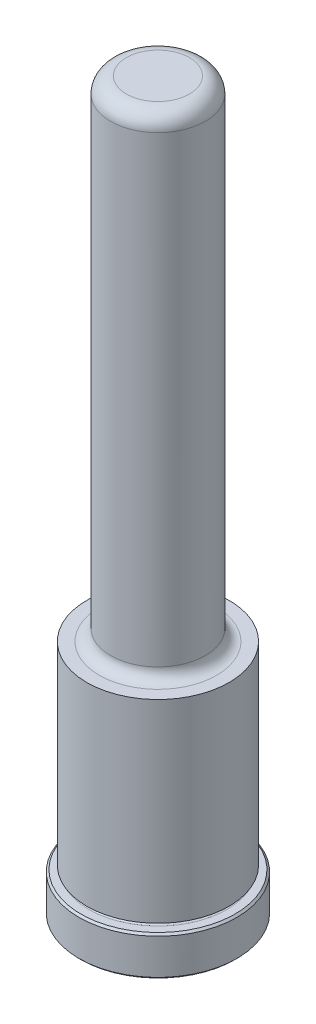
ISO-10303-21;
HEADER;
FILE_DESCRIPTION(('STEP AP214'),'2;1');
FILE_NAME('part.step','',(''),(''),'','','');
FILE_SCHEMA(('AUTOMOTIVE_DESIGN { 1 0 10303 214 1 1 1 1 }'));
ENDSEC;
DATA;
#1=APPLICATION_CONTEXT('core data for automotive mechanical design processes');
#2=APPLICATION_PROTOCOL_DEFINITION('international standard','automotive_design',2000,#1);
#3=PRODUCT_CONTEXT('',#1,'mechanical');
#4=PRODUCT('Part','Part','',(#3));
#5=PRODUCT_RELATED_PRODUCT_CATEGORY('part','',(#4));
#6=PRODUCT_DEFINITION_FORMATION('','',#4);
#7=PRODUCT_DEFINITION_CONTEXT('part definition',#1,'design');
#8=PRODUCT_DEFINITION('design','',#6,#7);
#9=PRODUCT_DEFINITION_SHAPE('','',#8);
#10=(LENGTH_UNIT() NAMED_UNIT(*) SI_UNIT(.MILLI.,.METRE.));
#11=(NAMED_UNIT(*) PLANE_ANGLE_UNIT() SI_UNIT($,.RADIAN.));
#12=(NAMED_UNIT(*) SI_UNIT($,.STERADIAN.) SOLID_ANGLE_UNIT());
#13=UNCERTAINTY_MEASURE_WITH_UNIT(LENGTH_MEASURE(1.E-05),#10,'distance_accuracy_value','');
#14=(GEOMETRIC_REPRESENTATION_CONTEXT(3) GLOBAL_UNCERTAINTY_ASSIGNED_CONTEXT((#13)) GLOBAL_UNIT_ASSIGNED_CONTEXT((#10,
#11,#12)) REPRESENTATION_CONTEXT('',''));
#15=CARTESIAN_POINT('',(0.,0.,0.));
#16=DIRECTION('',(0.,0.,1.));
#17=DIRECTION('',(1.,0.,0.));
#18=AXIS2_PLACEMENT_3D('',#15,#16,#17);
#19=CARTESIAN_POINT('',(0.,0.,0.));
#20=DIRECTION('',(0.,1.,0.));
#21=DIRECTION('',(0.,0.,1.));
#22=AXIS2_PLACEMENT_3D('',#19,#20,#21);
#23=PLANE('',#22);
#24=CARTESIAN_POINT('',(0.,0.,0.));
#25=DIRECTION('',(0.,1.,0.));
#26=DIRECTION('',(0.,0.,1.));
#27=AXIS2_PLACEMENT_3D('',#24,#25,#26);
#28=CIRCLE('',#27,15.494);
#29=CARTESIAN_POINT('',(0.,0.,15.494));
#30=VERTEX_POINT('',#29);
#31=EDGE_CURVE('E46',#30,#30,#28,.F.);
#32=ORIENTED_EDGE('',*,*,#31,.T.);
#33=EDGE_LOOP('',(#32));
#34=FACE_BOUND('',#33,.T.);
#35=ADVANCED_FACE('F31',(#34),#23,.F.);
#36=CARTESIAN_POINT('',(0.,0.,0.));
#37=DIRECTION('',(0.,1.,0.));
#38=DIRECTION('',(0.,0.,1.));
#39=AXIS2_PLACEMENT_3D('',#36,#37,#38);
#40=CYLINDRICAL_SURFACE('',#39,15.875);
#41=CARTESIAN_POINT('',(0.,0.38099999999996,0.));
#42=DIRECTION('',(0.,1.,0.));
#43=DIRECTION('',(0.,0.,1.));
#44=AXIS2_PLACEMENT_3D('',#41,#42,#43);
#45=CIRCLE('',#44,15.875);
#46=CARTESIAN_POINT('',(0.,0.380999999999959,15.875));
#47=VERTEX_POINT('',#46);
#48=EDGE_CURVE('E51',#47,#47,#45,.T.);
#49=ORIENTED_EDGE('',*,*,#48,.T.);
#50=EDGE_LOOP('',(#49));
#51=FACE_BOUND('',#50,.T.);
#52=CARTESIAN_POINT('',(0.,7.5438,0.));
#53=DIRECTION('',(0.,-1.,0.));
#54=DIRECTION('',(0.,0.,-1.));
#55=AXIS2_PLACEMENT_3D('',#52,#53,#54);
#56=CIRCLE('',#55,15.875);
#57=CARTESIAN_POINT('',(0.,7.5438,-15.875));
#58=VERTEX_POINT('',#57);
#59=EDGE_CURVE('E54',#58,#58,#56,.T.);
#60=ORIENTED_EDGE('',*,*,#59,.T.);
#61=EDGE_LOOP('',(#60));
#62=FACE_BOUND('',#61,.T.);
#63=ADVANCED_FACE('F110',(#51,#62),#40,.T.);
#64=CARTESIAN_POINT('',(0.,7.9248,-15.875));
#65=DIRECTION('',(0.,-1.,0.));
#66=DIRECTION('',(0.,0.,-1.));
#67=AXIS2_PLACEMENT_3D('',#64,#65,#66);
#68=PLANE('',#67);
#69=CARTESIAN_POINT('',(0.,7.9248,0.));
#70=DIRECTION('',(0.,-1.,0.));
#71=DIRECTION('',(0.,0.,-1.));
#72=AXIS2_PLACEMENT_3D('',#69,#70,#71);
#73=CIRCLE('',#72,15.494);
#74=CARTESIAN_POINT('',(0.,7.9248,-15.494));
#75=VERTEX_POINT('',#74);
#76=EDGE_CURVE('E42',#75,#75,#73,.F.);
#77=ORIENTED_EDGE('',*,*,#76,.T.);
#78=EDGE_LOOP('',(#77));
#79=FACE_BOUND('',#78,.T.);
#80=CARTESIAN_POINT('',(0.,7.9248,0.));
#81=DIRECTION('',(0.,1.,0.));
#82=DIRECTION('',(0.,0.,1.));
#83=AXIS2_PLACEMENT_3D('',#80,#81,#82);
#84=CIRCLE('',#83,13.8938);
#85=CARTESIAN_POINT('',(0.,7.9248,13.8938));
#86=VERTEX_POINT('',#85);
#87=EDGE_CURVE('E57',#86,#86,#84,.T.);
#88=ORIENTED_EDGE('',*,*,#87,.F.);
#89=EDGE_LOOP('',(#88));
#90=FACE_BOUND('',#89,.T.);
#91=ADVANCED_FACE('F105',(#79,#90),#68,.F.);
#92=CARTESIAN_POINT('',(0.,8.3058,0.));
#93=DIRECTION('',(0.,1.,0.));
#94=DIRECTION('',(0.,0.,1.));
#95=AXIS2_PLACEMENT_3D('',#92,#93,#94);
#96=TOROIDAL_SURFACE('',#95,13.8938,0.381000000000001);
#97=CARTESIAN_POINT('',(0.,8.68680000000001,0.));
#98=DIRECTION('',(0.,1.,0.));
#99=DIRECTION('',(0.,0.,1.));
#100=AXIS2_PLACEMENT_3D('',#97,#98,#99);
#101=CIRCLE('',#100,13.8938);
#102=CARTESIAN_POINT('',(0.,8.6868,13.8938));
#103=VERTEX_POINT('',#102);
#104=EDGE_CURVE('E60',#103,#103,#101,.T.);
#105=ORIENTED_EDGE('',*,*,#104,.F.);
#106=EDGE_LOOP('',(#105));
#107=FACE_BOUND('',#106,.T.);
#108=ORIENTED_EDGE('',*,*,#87,.T.);
#109=EDGE_LOOP('',(#108));
#110=FACE_BOUND('',#109,.T.);
#111=ADVANCED_FACE('F99',(#107,#110),#96,.F.);
#112=CARTESIAN_POINT('',(0.,8.68680000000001,-13.8938));
#113=DIRECTION('',(0.,1.,0.));
#114=DIRECTION('',(0.,0.,1.));
#115=AXIS2_PLACEMENT_3D('',#112,#113,#114);
#116=PLANE('',#115);
#117=CARTESIAN_POINT('',(0.,8.6868,0.));
#118=DIRECTION('',(0.,1.,0.));
#119=DIRECTION('',(0.,0.,1.));
#120=AXIS2_PLACEMENT_3D('',#117,#118,#119);
#121=CIRCLE('',#120,14.3002);
#122=CARTESIAN_POINT('',(0.,8.6868,14.3002));
#123=VERTEX_POINT('',#122);
#124=EDGE_CURVE('E63',#123,#123,#121,.T.);
#125=ORIENTED_EDGE('',*,*,#124,.F.);
#126=EDGE_LOOP('',(#125));
#127=FACE_BOUND('',#126,.T.);
#128=ORIENTED_EDGE('',*,*,#104,.T.);
#129=EDGE_LOOP('',(#128));
#130=FACE_BOUND('',#129,.T.);
#131=ADVANCED_FACE('F93',(#127,#130),#116,.F.);
#132=CARTESIAN_POINT('',(0.,0.,0.));
#133=DIRECTION('',(0.,1.,0.));
#134=DIRECTION('',(0.,0.,1.));
#135=AXIS2_PLACEMENT_3D('',#132,#133,#134);
#136=CYLINDRICAL_SURFACE('',#135,14.3002);
#137=CARTESIAN_POINT('',(0.,47.625,0.));
#138=DIRECTION('',(0.,1.,0.));
#139=DIRECTION('',(0.,0.,1.));
#140=AXIS2_PLACEMENT_3D('',#137,#138,#139);
#141=CIRCLE('',#140,14.3002);
#142=CARTESIAN_POINT('',(0.,47.625,14.3002));
#143=VERTEX_POINT('',#142);
#144=EDGE_CURVE('E66',#143,#143,#141,.T.);
#145=ORIENTED_EDGE('',*,*,#144,.F.);
#146=EDGE_LOOP('',(#145));
#147=FACE_BOUND('',#146,.T.);
#148=ORIENTED_EDGE('',*,*,#124,.T.);
#149=EDGE_LOOP('',(#148));
#150=FACE_BOUND('',#149,.T.);
#151=ADVANCED_FACE('F87',(#147,#150),#136,.T.);
#152=CARTESIAN_POINT('',(0.,47.625,-14.3002));
#153=DIRECTION('',(0.,-1.,0.));
#154=DIRECTION('',(0.,0.,-1.));
#155=AXIS2_PLACEMENT_3D('',#152,#153,#154);
#156=PLANE('',#155);
#157=CARTESIAN_POINT('',(0.,47.625,0.));
#158=DIRECTION('',(0.,1.,0.));
#159=DIRECTION('',(0.,0.,1.));
#160=AXIS2_PLACEMENT_3D('',#157,#158,#159);
#161=CIRCLE('',#160,11.7983);
#162=CARTESIAN_POINT('',(0.,47.625,11.7983));
#163=VERTEX_POINT('',#162);
#164=EDGE_CURVE('E69',#163,#163,#161,.T.);
#165=ORIENTED_EDGE('',*,*,#164,.F.);
#166=EDGE_LOOP('',(#165));
#167=FACE_BOUND('',#166,.T.);
#168=ORIENTED_EDGE('',*,*,#144,.T.);
#169=EDGE_LOOP('',(#168));
#170=FACE_BOUND('',#169,.T.);
#171=ADVANCED_FACE('F81',(#167,#170),#156,.F.);
#172=CARTESIAN_POINT('',(0.,49.911,0.));
#173=DIRECTION('',(0.,1.,0.));
#174=DIRECTION('',(0.,0.,1.));
#175=AXIS2_PLACEMENT_3D('',#172,#173,#174);
#176=TOROIDAL_SURFACE('',#175,11.7983,2.286);
#177=CARTESIAN_POINT('',(0.,49.911,0.));
#178=DIRECTION('',(0.,1.,0.));
#179=DIRECTION('',(0.,0.,1.));
#180=AXIS2_PLACEMENT_3D('',#177,#178,#179);
#181=CIRCLE('',#180,9.5123);
#182=CARTESIAN_POINT('',(0.,49.911,9.5123));
#183=VERTEX_POINT('',#182);
#184=EDGE_CURVE('E72',#183,#183,#181,.T.);
#185=ORIENTED_EDGE('',*,*,#184,.F.);
#186=EDGE_LOOP('',(#185));
#187=FACE_BOUND('',#186,.T.);
#188=ORIENTED_EDGE('',*,*,#164,.T.);
#189=EDGE_LOOP('',(#188));
#190=FACE_BOUND('',#189,.T.);
#191=ADVANCED_FACE('F78',(#187,#190),#176,.F.);
#192=CARTESIAN_POINT('',(0.,0.,0.));
#193=DIRECTION('',(0.,1.,0.));
#194=DIRECTION('',(0.,0.,1.));
#195=AXIS2_PLACEMENT_3D('',#192,#193,#194);
#196=CYLINDRICAL_SURFACE('',#195,9.5123);
#197=CARTESIAN_POINT('',(0.,142.875,0.));
#198=DIRECTION('',(0.,-1.,0.));
#199=DIRECTION('',(0.,0.,-1.));
#200=AXIS2_PLACEMENT_3D('',#197,#198,#199);
#201=CIRCLE('',#200,9.5123);
#202=CARTESIAN_POINT('',(0.,142.875,-9.51229999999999));
#203=VERTEX_POINT('',#202);
#204=EDGE_CURVE('E10',#203,#203,#201,.T.);
#205=ORIENTED_EDGE('',*,*,#204,.T.);
#206=EDGE_LOOP('',(#205));
#207=FACE_BOUND('',#206,.T.);
#208=ORIENTED_EDGE('',*,*,#184,.T.);
#209=EDGE_LOOP('',(#208));
#210=FACE_BOUND('',#209,.T.);
#211=ADVANCED_FACE('F76',(#207,#210),#196,.T.);
#212=CARTESIAN_POINT('',(0.,146.05,-9.51229999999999));
#213=DIRECTION('',(0.,-1.,0.));
#214=DIRECTION('',(0.,0.,-1.));
#215=AXIS2_PLACEMENT_3D('',#212,#213,#214);
#216=PLANE('',#215);
#217=CARTESIAN_POINT('',(0.,146.05,0.));
#218=DIRECTION('',(0.,-1.,0.));
#219=DIRECTION('',(0.,0.,-1.));
#220=AXIS2_PLACEMENT_3D('',#217,#218,#219);
#221=CIRCLE('',#220,6.3373);
#222=CARTESIAN_POINT('',(0.,146.05,-6.33729999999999));
#223=VERTEX_POINT('',#222);
#224=EDGE_CURVE('E38',#223,#223,#221,.F.);
#225=ORIENTED_EDGE('',*,*,#224,.T.);
#226=EDGE_LOOP('',(#225));
#227=FACE_BOUND('',#226,.T.);
#228=ADVANCED_FACE('F127',(#227),#216,.F.);
#229=CARTESIAN_POINT('',(0.,0.38099999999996,0.));
#230=DIRECTION('',(0.,1.,0.));
#231=DIRECTION('',(0.,0.,1.));
#232=AXIS2_PLACEMENT_3D('',#229,#230,#231);
#233=CONICAL_SURFACE('',#232,15.875,0.785398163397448);
#234=CARTESIAN_POINT('',(0.,0.,15.494));
#235=CARTESIAN_POINT('',(0.,0.003968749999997,15.49796875));
#236=CARTESIAN_POINT('',(0.,0.00793749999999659,15.5019375));
#237=CARTESIAN_POINT('',(0.,0.0158749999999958,15.509875));
#238=CARTESIAN_POINT('',(0.,0.0198437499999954,15.51384375));
#239=CARTESIAN_POINT('',(0.,0.0277812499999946,15.52178125));
#240=CARTESIAN_POINT('',(0.,0.0317499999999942,15.52575));
#241=CARTESIAN_POINT('',(0.,0.0396874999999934,15.5336875));
#242=CARTESIAN_POINT('',(0.,0.043656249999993,15.53765625));
#243=CARTESIAN_POINT('',(0.,0.0515937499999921,15.54559375));
#244=CARTESIAN_POINT('',(0.,0.0555624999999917,15.5495625));
#245=CARTESIAN_POINT('',(0.,0.0634999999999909,15.5575));
#246=CARTESIAN_POINT('',(0.,0.0674687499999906,15.56146875));
#247=CARTESIAN_POINT('',(0.,0.0754062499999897,15.56940625));
#248=CARTESIAN_POINT('',(0.,0.0793749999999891,15.573375));
#249=CARTESIAN_POINT('',(0.,0.0873124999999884,15.5813125));
#250=CARTESIAN_POINT('',(0.,0.0912812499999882,15.58528125));
#251=CARTESIAN_POINT('',(0.,0.0992187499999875,15.59321875));
#252=CARTESIAN_POINT('',(0.,0.103187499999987,15.5971875));
#253=CARTESIAN_POINT('',(0.,0.111124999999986,15.605125));
#254=CARTESIAN_POINT('',(0.,0.115093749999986,15.60909375));
#255=CARTESIAN_POINT('',(0.,0.123031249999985,15.61703125));
#256=CARTESIAN_POINT('',(0.,0.126999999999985,15.621));
#257=CARTESIAN_POINT('',(0.,0.134937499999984,15.6289375));
#258=CARTESIAN_POINT('',(0.,0.138906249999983,15.63290625));
#259=CARTESIAN_POINT('',(0.,0.146843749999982,15.64084375));
#260=CARTESIAN_POINT('',(0.,0.150812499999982,15.6448125));
#261=CARTESIAN_POINT('',(0.,0.158749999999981,15.65275));
#262=CARTESIAN_POINT('',(0.,0.162718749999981,15.65671875));
#263=CARTESIAN_POINT('',(0.,0.17065624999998,15.66465625));
#264=CARTESIAN_POINT('',(0.,0.174624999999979,15.668625));
#265=CARTESIAN_POINT('',(0.,0.182562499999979,15.6765625));
#266=CARTESIAN_POINT('',(0.,0.186531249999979,15.68053125));
#267=CARTESIAN_POINT('',(0.,0.194468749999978,15.68846875));
#268=CARTESIAN_POINT('',(0.,0.198437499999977,15.6924375));
#269=CARTESIAN_POINT('',(0.,0.206374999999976,15.700375));
#270=CARTESIAN_POINT('',(0.,0.210343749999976,15.70434375));
#271=CARTESIAN_POINT('',(0.,0.218281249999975,15.71228125));
#272=CARTESIAN_POINT('',(0.,0.222249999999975,15.71625));
#273=CARTESIAN_POINT('',(0.,0.230187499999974,15.7241875));
#274=CARTESIAN_POINT('',(0.,0.234156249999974,15.72815625));
#275=CARTESIAN_POINT('',(0.,0.242093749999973,15.73609375));
#276=CARTESIAN_POINT('',(0.,0.246062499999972,15.7400625));
#277=CARTESIAN_POINT('',(0.,0.253999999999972,15.748));
#278=CARTESIAN_POINT('',(0.,0.257968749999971,15.75196875));
#279=CARTESIAN_POINT('',(0.,0.26590624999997,15.75990625));
#280=CARTESIAN_POINT('',(0.,0.26987499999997,15.763875));
#281=CARTESIAN_POINT('',(0.,0.277812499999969,15.7718125));
#282=CARTESIAN_POINT('',(0.,0.281781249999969,15.77578125));
#283=CARTESIAN_POINT('',(0.,0.289718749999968,15.78371875));
#284=CARTESIAN_POINT('',(0.,0.293687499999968,15.7876875));
#285=CARTESIAN_POINT('',(0.,0.301624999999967,15.795625));
#286=CARTESIAN_POINT('',(0.,0.305593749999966,15.79959375));
#287=CARTESIAN_POINT('',(0.,0.313531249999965,15.80753125));
#288=CARTESIAN_POINT('',(0.,0.317499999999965,15.8115));
#289=CARTESIAN_POINT('',(0.,0.325437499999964,15.8194375));
#290=CARTESIAN_POINT('',(0.,0.329406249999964,15.82340625));
#291=CARTESIAN_POINT('',(0.,0.337343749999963,15.83134375));
#292=CARTESIAN_POINT('',(0.,0.341312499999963,15.8353125));
#293=CARTESIAN_POINT('',(0.,0.349249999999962,15.84325));
#294=CARTESIAN_POINT('',(0.,0.353218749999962,15.84721875));
#295=CARTESIAN_POINT('',(0.,0.361156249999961,15.85515625));
#296=CARTESIAN_POINT('',(0.,0.36512499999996,15.859125));
#297=CARTESIAN_POINT('',(0.,0.373062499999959,15.8670625));
#298=CARTESIAN_POINT('',(0.,0.377031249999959,15.87103125));
#299=CARTESIAN_POINT('',(0.,0.380999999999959,15.875));
#300=B_SPLINE_CURVE_WITH_KNOTS('',3,(#234,#235,#236,#237,#238,#239,#240,#241,#242,#243,#244,
#245,#246,#247,#248,#249,#250,#251,#252,#253,#254,#255,#256,#257,#258,#259,#260,#261,#262,#263,
#264,#265,#266,#267,#268,#269,#270,#271,#272,#273,#274,#275,#276,#277,#278,#279,#280,#281,#282,
#283,#284,#285,#286,#287,#288,#289,#290,#291,#292,#293,#294,#295,#296,#297,#298,#299),
.UNSPECIFIED.,.F.,.F.,(4,2,2,2,2,2,2,2,2,2,2,2,2,2,2,2,2,2,2,2,2,2,2,2,2,2,2,2,2,2,2,2,4),(0.,
0.016837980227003,0.0336759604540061,0.0505139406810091,0.0673519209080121,0.0841899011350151,
0.101027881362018,0.117865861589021,0.134703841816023,0.151541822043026,0.168379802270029,
0.185217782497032,0.202055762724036,0.218893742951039,0.235731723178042,0.252569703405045,
0.269407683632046,0.286245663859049,0.303083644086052,0.319921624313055,0.336759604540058,
0.353597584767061,0.370435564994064,0.387273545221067,0.40411152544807,0.420949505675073,
0.437787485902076,0.454625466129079,0.471463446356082,0.488301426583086,0.505139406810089,
0.521977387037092,0.538815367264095),.UNSPECIFIED.);
#301=EDGE_CURVE('BSEAM124',#30,#47,#300,.T.);
#302=ORIENTED_EDGE('',*,*,#31,.F.);
#303=ORIENTED_EDGE('',*,*,#48,.F.);
#304=ORIENTED_EDGE('',*,*,#301,.T.);
#305=ORIENTED_EDGE('',*,*,#301,.F.);
#306=EDGE_LOOP('',(#302,#304,#303,#305));
#307=FACE_BOUND('',#306,.T.);
#308=ADVANCED_FACE('F124',(#307),#233,.T.);
#309=CARTESIAN_POINT('',(0.,7.9248,0.));
#310=DIRECTION('',(0.,-1.,0.));
#311=DIRECTION('',(0.,0.,-1.));
#312=AXIS2_PLACEMENT_3D('',#309,#310,#311);
#313=CONICAL_SURFACE('',#312,15.494,0.78539816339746);
#314=ORIENTED_EDGE('',*,*,#59,.F.);
#315=EDGE_LOOP('',(#314));
#316=FACE_BOUND('',#315,.T.);
#317=ORIENTED_EDGE('',*,*,#76,.F.);
#318=EDGE_LOOP('',(#317));
#319=FACE_BOUND('',#318,.T.);
#320=ADVANCED_FACE('F126',(#316,#319),#313,.T.);
#321=CARTESIAN_POINT('',(0.,142.875,0.));
#322=DIRECTION('',(0.,-1.,0.));
#323=DIRECTION('',(0.,0.,-1.));
#324=AXIS2_PLACEMENT_3D('',#321,#322,#323);
#325=TOROIDAL_SURFACE('',#324,6.3373,3.175);
#326=ORIENTED_EDGE('',*,*,#204,.F.);
#327=EDGE_LOOP('',(#326));
#328=FACE_BOUND('',#327,.T.);
#329=ORIENTED_EDGE('',*,*,#224,.F.);
#330=EDGE_LOOP('',(#329));
#331=FACE_BOUND('',#330,.T.);
#332=ADVANCED_FACE('F33',(#328,#331),#325,.T.);
#333=CLOSED_SHELL('',(#35,#63,#91,#111,#131,#151,#171,#191,#211,#228,#308,#320,#332));
#334=MANIFOLD_SOLID_BREP('B2',#333);
#335=ADVANCED_BREP_SHAPE_REPRESENTATION('',(#18,#334),#14);
#336=SHAPE_DEFINITION_REPRESENTATION(#9,#335);
ENDSEC;
END-ISO-10303-21;
